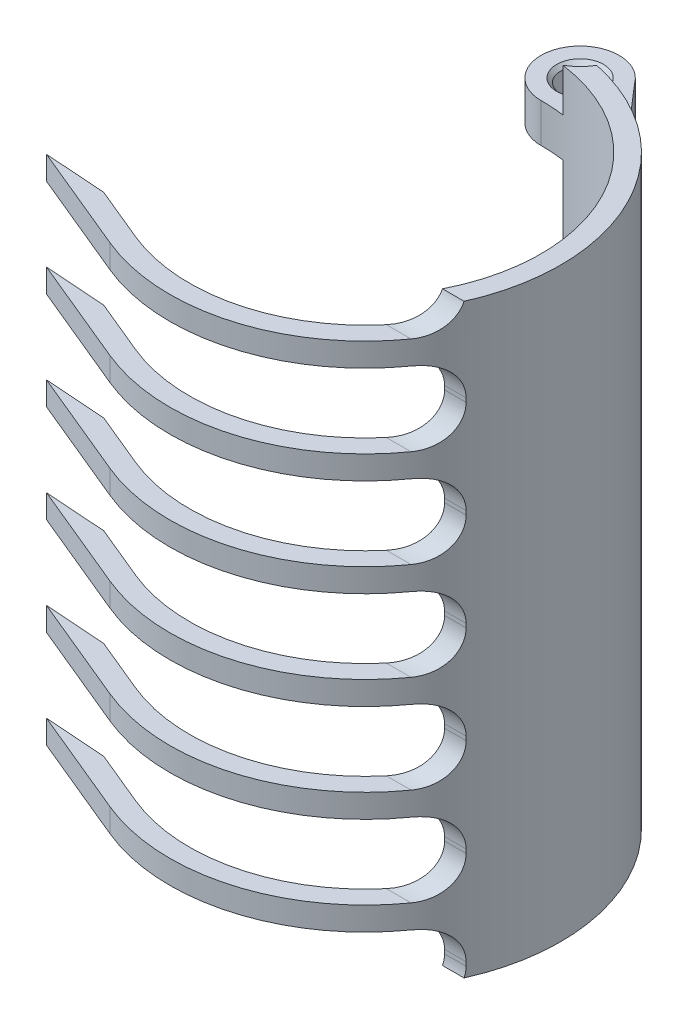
from build123d import *

# Parameters (mm, degrees)
BOSS_EXTRUDE1_DEPTH     = 150
CUT_EXTRUDE1_DEPTH      = 166.831239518
CUT_EXTRUDE1_DEPTH_BACK = 166.831239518
BOSS_EXTRUDE2_START     = -11
SKETCH4_R               = 5
BOSS_EXTRUDE2_DEPTH     = 10
BOSS_EXTRUDE3_START     = -129
SKETCH4_2_R             = 5
BOSS_EXTRUDE3_DEPTH     = 10
SKETCH5_R               = 12
CUT_EXTRUDE2_DEPTH      = 11
CUT_EXTRUDE3_START      = -139
SKETCH5_2_R             = 12
CUT_EXTRUDE3_DEPTH      = 11
CUT_EXTRUDE4_START      = -21
SKETCH5_3_R             = 12
CUT_EXTRUDE4_DEPTH      = 108
CHAMFER1_SIZE           = 1


with BuildPart() as part:
    # Sketch1 → Boss-Extrude1 (new body)
    with BuildSketch(Plane(origin=(0, 0, 0), x_dir=(1, 0, 0), z_dir=(0, 1, 0))):
        with BuildLine():
            Line((0, 50), (0, 45))
            ThreePointArc((0, 45), (44.135337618, -8.779064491), (-17.220754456, -41.574578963))
            Line((-17.220754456, -41.574578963), (-31.078947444, -35.834327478))
            Line((-31.078947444, -35.834327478), (-46.850557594, -34.713473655))
            Line((-46.850557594, -34.713473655), (-19.134171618, -46.193976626))
            ThreePointArc((-19.134171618, -46.193976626), (49.03926402, -9.754516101), (0, 50))
        make_face()
    extrude(amount=BOSS_EXTRUDE1_DEPTH)

    # Sketch2 → Cut-Extrude1 (cut, two sides: drawn at the far end of the back side and taken through both)
    with BuildSketch(Plane(origin=(0, 0, 0), x_dir=(0, 0, -1), z_dir=(1, 0, 0)).offset(-CUT_EXTRUDE1_DEPTH_BACK)):
        with BuildLine():
            Line((-50, 162.5), (-29, 162.5))
            ThreePointArc((-29, 162.5), (-22.636038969, 159.863961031), (-20, 153.5))
            Line((-20, 153.5), (-20, 152.5))
            ThreePointArc((-20, 152.5), (-22.636038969, 146.136038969), (-29, 143.5))
            Line((-29, 143.5), (-50, 143.5))
            Line((-50, 143.5), (-50, 162.5))
        make_face()
        with BuildLine():
            Line((-50, 118.5), (-29, 118.5))
            ThreePointArc((-29, 118.5), (-22.636038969, 121.136038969), (-20, 127.5))
            Line((-20, 127.5), (-20, 128.5))
            ThreePointArc((-20, 128.5), (-22.636038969, 134.863961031), (-29, 137.5))
            Line((-29, 137.5), (-50, 137.5))
            Line((-50, 137.5), (-50, 118.5))
        make_face()
        with BuildLine():
            Line((-50, 93.5), (-29, 93.5))
            ThreePointArc((-29, 93.5), (-22.636038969, 96.136038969), (-20, 102.5))
            Line((-20, 102.5), (-20, 103.5))
            ThreePointArc((-20, 103.5), (-22.636038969, 109.863961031), (-29, 112.5))
            Line((-29, 112.5), (-50, 112.5))
            Line((-50, 112.5), (-50, 93.5))
        make_face()
        with BuildLine():
            Line((-50, 68.5), (-29, 68.5))
            ThreePointArc((-29, 68.5), (-22.636038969, 71.136038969), (-20, 77.5))
            Line((-20, 77.5), (-20, 78.5))
            ThreePointArc((-20, 78.5), (-22.636038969, 84.863961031), (-29, 87.5))
            Line((-29, 87.5), (-50, 87.5))
            Line((-50, 87.5), (-50, 68.5))
        make_face()
        with BuildLine():
            Line((-50, 43.5), (-29, 43.5))
            ThreePointArc((-29, 43.5), (-22.636038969, 46.136038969), (-20, 52.5))
            Line((-20, 52.5), (-20, 53.5))
            ThreePointArc((-20, 53.5), (-22.636038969, 59.863961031), (-29, 62.5))
            Line((-29, 62.5), (-50, 62.5))
            Line((-50, 62.5), (-50, 43.5))
        make_face()
        with BuildLine():
            Line((-50, 18.5), (-29, 18.5))
            ThreePointArc((-29, 18.5), (-22.636038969, 21.136038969), (-20, 27.5))
            Line((-20, 27.5), (-20, 28.5))
            ThreePointArc((-20, 28.5), (-22.636038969, 34.863961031), (-29, 37.5))
            Line((-29, 37.5), (-50, 37.5))
            Line((-50, 37.5), (-50, 18.5))
        make_face()
        with BuildLine():
            Line((-50, -6.5), (-29, -6.5))
            ThreePointArc((-29, -6.5), (-22.636038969, -3.863961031), (-20, 2.5))
            Line((-20, 2.5), (-20, 3.5))
            ThreePointArc((-20, 3.5), (-22.636038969, 9.863961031), (-29, 12.5))
            Line((-29, 12.5), (-50, 12.5))
            Line((-50, 12.5), (-50, -6.5))
        make_face()
        with BuildLine():
            Line((-50, -31.5), (-29, -31.5))
            ThreePointArc((-29, -31.5), (-22.636038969, -28.863961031), (-20, -22.5))
            Line((-20, -22.5), (-20, -21.5))
            ThreePointArc((-20, -21.5), (-22.636038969, -15.136038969), (-29, -12.5))
            Line((-29, -12.5), (-50, -12.5))
            Line((-50, -12.5), (-50, -31.5))
        make_face()
        with BuildLine():
            Line((-50, -56.5), (-29, -56.5))
            ThreePointArc((-29, -56.5), (-22.636038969, -53.863961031), (-20, -47.5))
            Line((-20, -47.5), (-20, -46.5))
            ThreePointArc((-20, -46.5), (-22.636038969, -40.136038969), (-29, -37.5))
            Line((-29, -37.5), (-50, -37.5))
            Line((-50, -37.5), (-50, -56.5))
        make_face()
        with BuildLine():
            Line((-50, -81.5), (-29, -81.5))
            ThreePointArc((-29, -81.5), (-22.636038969, -78.863961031), (-20, -72.5))
            Line((-20, -72.5), (-20, -71.5))
            ThreePointArc((-20, -71.5), (-22.636038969, -65.136038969), (-29, -62.5))
            Line((-29, -62.5), (-50, -62.5))
            Line((-50, -62.5), (-50, -81.5))
        make_face()
        with BuildLine():
            Line((-50, -106.5), (-29, -106.5))
            ThreePointArc((-29, -106.5), (-22.636038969, -103.863961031), (-20, -97.5))
            Line((-20, -97.5), (-20, -96.5))
            ThreePointArc((-20, -96.5), (-22.636038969, -90.136038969), (-29, -87.5))
            Line((-29, -87.5), (-50, -87.5))
            Line((-50, -87.5), (-50, -106.5))
        make_face()
    extrude(amount=CUT_EXTRUDE1_DEPTH + CUT_EXTRUDE1_DEPTH_BACK, mode=Mode.SUBTRACT)

    # Sketch4 → Boss-Extrude2 (add)
    with BuildSketch(Plane(origin=(0, 0, 0), x_dir=(-1, 0, 0), z_dir=(0, -1, 0)).offset(BOSS_EXTRUDE2_START)):
        with BuildLine():
            Line((-21.794494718, 45), (-8.074338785, 60.899580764))
            ThreePointArc((-8.074338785, 60.899580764), (9.728009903, 57.316424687), (-4.548982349, 46.094565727))
            Line((-4.548982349, 46.094565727), (-21.794494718, 45))
        make_face()
        with Locations(Location((0, 55, 0), (0, 0, 270))):
            Circle(SKETCH4_R, mode=Mode.SUBTRACT)
    extrude(amount=-BOSS_EXTRUDE2_DEPTH)

    # Sketch4_2 → Boss-Extrude3 (add)
    with BuildSketch(Plane(origin=(0, 0, 0), x_dir=(-1, 0, 0), z_dir=(0, -1, 0)).offset(BOSS_EXTRUDE3_START)):
        with BuildLine():
            Line((-21.794494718, 45), (-8.074338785, 60.899580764))
            ThreePointArc((-8.074338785, 60.899580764), (9.728009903, 57.316424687), (-4.548982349, 46.094565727))
            Line((-4.548982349, 46.094565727), (-21.794494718, 45))
        make_face()
        with Locations(Location((0, 55, 0), (0, 0, 270))):
            Circle(SKETCH4_2_R, mode=Mode.SUBTRACT)
    extrude(amount=-BOSS_EXTRUDE3_DEPTH)

    # Sketch5 → Cut-Extrude2 (cut)
    with BuildSketch(Plane(origin=(0, 150, 0), x_dir=(1, 0, 0), z_dir=(0, 1, 0))):
        with Locations((0, 55)):
            Circle(SKETCH5_R)
    extrude(amount=-CUT_EXTRUDE2_DEPTH, mode=Mode.SUBTRACT)

    # Sketch5_2 → Cut-Extrude3 (cut)
    with BuildSketch(Plane(origin=(0, 150, 0), x_dir=(1, 0, 0), z_dir=(0, 1, 0)).offset(CUT_EXTRUDE3_START)):
        with Locations((0, 55)):
            Circle(SKETCH5_2_R)
    extrude(amount=-CUT_EXTRUDE3_DEPTH, mode=Mode.SUBTRACT)

    # Sketch5_3 → Cut-Extrude4 (cut)
    with BuildSketch(Plane(origin=(0, 150, 0), x_dir=(1, 0, 0), z_dir=(0, 1, 0)).offset(CUT_EXTRUDE4_START)):
        with Locations((0, 55)):
            Circle(SKETCH5_3_R)
    extrude(amount=-CUT_EXTRUDE4_DEPTH, mode=Mode.SUBTRACT)

    # Chamfer1
    chamfer1_edges = [part.edges().sort_by_distance(p)[0] for p in [
        (0, 21, -60),
        (0, 11, -60),
        (0, 139, -60),
        (0, 129, -60),
    ]]
    chamfer(chamfer1_edges, length=CHAMFER1_SIZE)


solid = part.part
